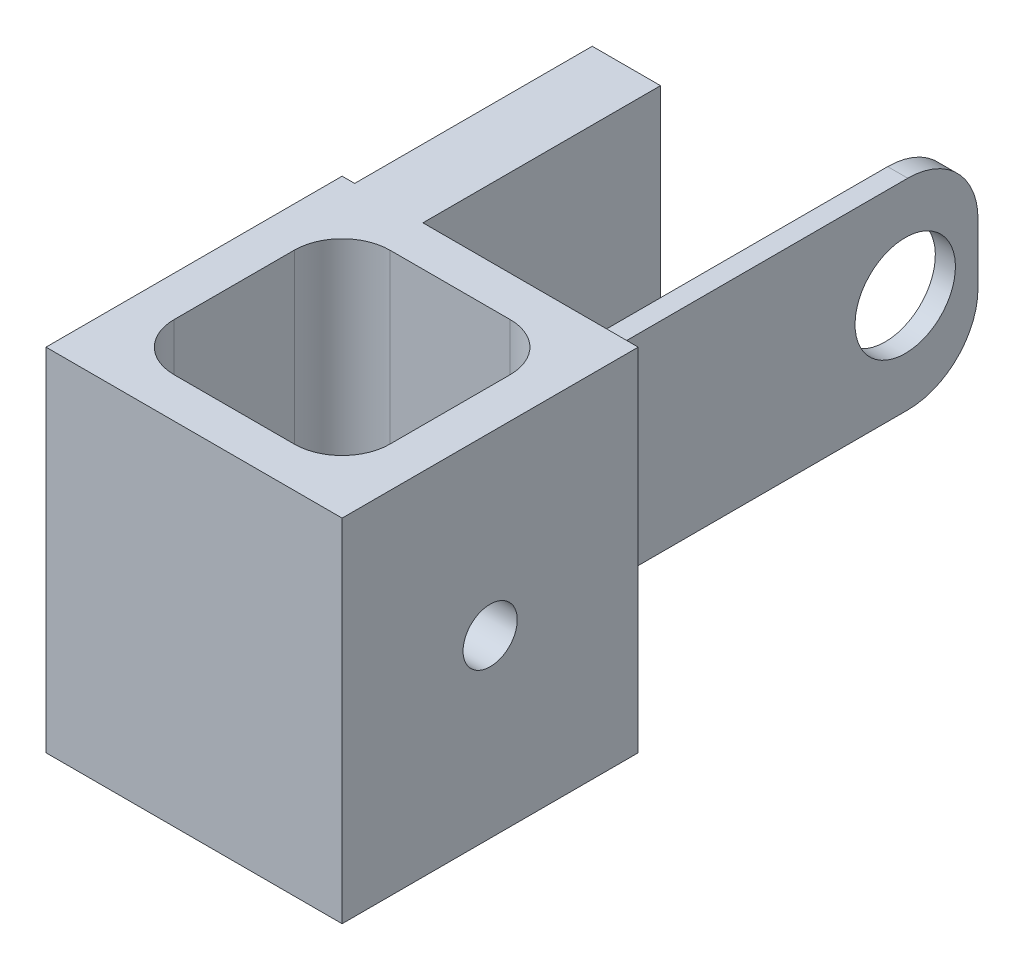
from build123d import *

# Parameters (mm, degrees)
BOSS_EXTRUDE1_DEPTH                  = 35
SKETCH2_W                            = 2
SKETCH2_H                            = 20
BOSS_EXTRUDE2_DEPTH                  = 43.5
SKETCH3_R                            = 5
CUT_EXTRUDE1_DEPTH                   = 70.434753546
FILLET1_R                            = 7
SKETCH4_W                            = 6.8
SKETCH4_H                            = 35
BOSS_EXTRUDE3_DEPTH                  = 24.67
BOSS_EXTRUDE3_DIRECTION_2_REACH      = 59.501
BOSS_EXTRUDE3_DIRECTION_2_END_RADIUS = 7.76
F_4_40_TAPPED_HOLE1_AT_2_COUNT       = 2
F_4_40_TAPPED_HOLE1_AT_2_PITCH       = 29
SKETCH17_R                           = 2.7
CUT_EXTRUDE3_DEPTH                   = 73.51767026
BOSS_EXTRUDE6_START                  = -35
SKETCH18_W                           = 29.5
SKETCH18_H                           = 29.5
BOSS_EXTRUDE6_DEPTH                  = 35
CUT_EXTRUDE4_DEPTH                   = 72.783093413
CUT_EXTRUDE4_DEPTH_BACK              = 72.783093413
SKETCH19_R                           = 2.7


with BuildPart() as part:
    # Sketch1 → Boss-Extrude1 (new body)
    with BuildSketch(Plane(origin=(0, 0, 0), x_dir=(1, 0, 0), z_dir=(0, 1, 0))):
        with BuildLine():
            Line((-5.99, 13.75), (5.99, 13.75))
            ThreePointArc((5.99, 13.75), (11.477148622, 11.477148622), (13.75, 5.99))
            Line((13.75, 5.99), (13.75, -5.99))
            ThreePointArc((13.75, -5.99), (11.477148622, -11.477148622), (5.99, -13.75))
            Line((5.99, -13.75), (-5.99, -13.75))
            ThreePointArc((-5.99, -13.75), (-11.477148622, -11.477148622), (-13.75, -5.99))
            Line((-13.75, -5.99), (-13.75, 5.99))
            ThreePointArc((-13.75, 5.99), (-11.477148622, 11.477148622), (-5.99, 13.75))
        make_face()
        with BuildLine():
            Line((-5.99, -10.75), (5.99, -10.75))
            ThreePointArc((5.99, -10.75), (9.355828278, -9.355828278), (10.75, -5.99))
            Line((10.75, -5.99), (10.75, 5.99))
            ThreePointArc((10.75, 5.99), (9.355828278, 9.355828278), (5.99, 10.75))
            Line((5.99, 10.75), (-5.99, 10.75))
            ThreePointArc((-5.99, 10.75), (-9.355828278, 9.355828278), (-10.75, 5.99))
            Line((-10.75, 5.99), (-10.75, -5.99))
            ThreePointArc((-10.75, -5.99), (-9.355828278, -9.355828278), (-5.99, -10.75))
        make_face(mode=Mode.SUBTRACT)
    extrude(amount=BOSS_EXTRUDE1_DEPTH)

    # Sketch2 → Boss-Extrude2 (add)
    with BuildSketch(Plane(origin=(0, 0, -13.75), x_dir=(-1, 0, 0), z_dir=(0, 0, -1))):
        with Locations((-5.1, 17.5)):
            Rectangle(SKETCH2_W, SKETCH2_H)
    extrude(amount=BOSS_EXTRUDE2_DEPTH)

    # Sketch3 → Cut-Extrude1 (cut, through all)
    with BuildSketch(Plane.ZY.offset(-4.1)):
        with Locations(Location((-50, 17.5, 0), (0, 0, 270))):
            Circle(SKETCH3_R)
    extrude(amount=-CUT_EXTRUDE1_DEPTH, mode=Mode.SUBTRACT)

    # Fillet1
    fillet1_edges = [part.edges().sort_by_distance(p)[0] for p in [
        (5.1, 7.5, -57.25),
        (5.1, 27.5, -57.25),
    ]]
    fillet(fillet1_edges, radius=FILLET1_R)

    # Sketch17 → Cut-Extrude3 (cut, through all)
    with BuildSketch(Plane(origin=(13.75, 0, 0), x_dir=(0, 0, -1), z_dir=(1, 0, 0))):
        with Locations((0, 17.5)):
            Circle(SKETCH17_R)
    extrude(amount=-CUT_EXTRUDE3_DEPTH, mode=Mode.SUBTRACT)



with BuildPart() as body_2:
    # Sketch4 → Boss-Extrude3 (new body)
    with BuildSketch(Plane(origin=(0, 0, -13.75), x_dir=(-1, 0, 0), z_dir=(0, 0, -1))):
        with Locations((10.1, 17.5)):
            Rectangle(SKETCH4_W, SKETCH4_H)
    extrude(amount=BOSS_EXTRUDE3_DEPTH)

    # Boss-Extrude3 direction 2: up to this cylinder (the profile starts outside it)
    boss_extrude3_direction_2_end = Plane(origin=(-5.99, 17.5, -5.99), z_dir=(0, -1, 0)) * Cylinder(BOSS_EXTRUDE3_DIRECTION_2_END_RADIUS, 135.522, mode=Mode.PRIVATE)
    # Sketch4 → Boss-Extrude3 direction 2 (add, up to the surface)
    with BuildSketch(Plane(origin=(0, 0, -13.75), x_dir=(-1, 0, 0), z_dir=(0, 0, -1)), mode=Mode.PRIVATE) as boss_extrude3_direction_2_sk1:
        with Locations((10.1, 17.5)):
            Rectangle(SKETCH4_W, SKETCH4_H)
    boss_extrude3_direction_2_tool1 = extrude(boss_extrude3_direction_2_sk1.sketch, amount=-BOSS_EXTRUDE3_DIRECTION_2_REACH, mode=Mode.PRIVATE) - boss_extrude3_direction_2_end
    add(boss_extrude3_direction_2_tool1.solids().sort_by_distance((-10.1, 17.5, -13.75))[0])

    # Sketch15 → 4-40 Tapped Hole1 (revolve, cut)
    with BuildSketch(Plane(origin=(-10.1, 32, -38.42), x_dir=(0, 1, 0), z_dir=(1, 0, 0))):
        Polygon((0, 0), (0, 20.679152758), (1.1303, 20), (1.1303, 0), align=None)
    f_4_40_tapped_hole1 = revolve(axis=Axis((-10.1, 32, -44.77), (0, 0, 1)), mode=Mode.SUBTRACT)

    # 4-40 Tapped Hole1 at 2: 4-40 Tapped Hole1 ×2
    with Locations(*[(0, -i * F_4_40_TAPPED_HOLE1_AT_2_PITCH, 0) for i in range(1, F_4_40_TAPPED_HOLE1_AT_2_COUNT)]):
        add(f_4_40_tapped_hole1, mode=Mode.SUBTRACT)


with BuildPart() as part_1:
    add(part.part)

    add(body_2.part)  # Boss-Extrude6 merges body 2
    # Sketch18 → Boss-Extrude6 (add)
    # profile 1 of 5: a face of its own
    with BuildSketch(Plane(origin=(0, 35, 0), x_dir=(1, 0, 0), z_dir=(0, 1, 0)).offset(BOSS_EXTRUDE6_START)):
        Rectangle(SKETCH18_W, SKETCH18_H)
        Polygon((13.75, -13.75), (13.75, -5.99), (13.75, 5.99), (13.75, 13.75), (5.99, 13.75), (-5.99, 13.75), (-13.75, 13.75), (-13.75, 5.99), (-13.75, -5.99), (-13.75, -13.75), (-5.99, -13.75), (5.99, -13.75), align=None, mode=Mode.SUBTRACT)
    # profile 2 of 5: a face of its own
    with BuildSketch(Plane(origin=(0, 35, 0), x_dir=(1, 0, 0), z_dir=(0, 1, 0)).offset(BOSS_EXTRUDE6_START)):
        with BuildLine():
            Line((-13.75, 13.75), (-5.99, 13.75))
            ThreePointArc((-5.99, 13.75), (-11.477148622, 11.477148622), (-13.75, 5.99))
            Line((-13.75, 5.99), (-13.75, 13.75))
        make_face()
    # profile 3 of 5: a face of its own
    with BuildSketch(Plane(origin=(0, 35, 0), x_dir=(1, 0, 0), z_dir=(0, 1, 0)).offset(BOSS_EXTRUDE6_START)):
        with BuildLine():
            Line((13.75, 13.75), (13.75, 5.99))
            ThreePointArc((13.75, 5.99), (11.477148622, 11.477148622), (5.99, 13.75))
            Line((5.99, 13.75), (13.75, 13.75))
        make_face()
    # profile 4 of 5: a face of its own
    with BuildSketch(Plane(origin=(0, 35, 0), x_dir=(1, 0, 0), z_dir=(0, 1, 0)).offset(BOSS_EXTRUDE6_START)):
        with BuildLine():
            Line((5.99, -13.75), (13.75, -13.75))
            Line((13.75, -13.75), (13.75, -5.99))
            ThreePointArc((13.75, -5.99), (11.477148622, -11.477148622), (5.99, -13.75))
        make_face()
    # profile 5 of 5: a face of its own
    with BuildSketch(Plane(origin=(0, 35, 0), x_dir=(1, 0, 0), z_dir=(0, 1, 0)).offset(BOSS_EXTRUDE6_START)):
        with BuildLine():
            Line((-13.75, -5.99), (-13.75, -13.75))
            Line((-13.75, -13.75), (-5.99, -13.75))
            ThreePointArc((-5.99, -13.75), (-11.477148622, -11.477148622), (-13.75, -5.99))
        make_face()
    extrude(amount=BOSS_EXTRUDE6_DEPTH)

    # Sketch19 → Cut-Extrude4 (cut, two sides: drawn at the far end of the back side and taken through both)
    with BuildSketch(Plane.ZY.offset(-10.75).offset(-CUT_EXTRUDE4_DEPTH_BACK)):
        with Locations(Location((0, 17.5, 0), (0, 0, 180))):
            Circle(SKETCH19_R)
    extrude(amount=CUT_EXTRUDE4_DEPTH + CUT_EXTRUDE4_DEPTH_BACK, mode=Mode.SUBTRACT)


solid = part_1.part
